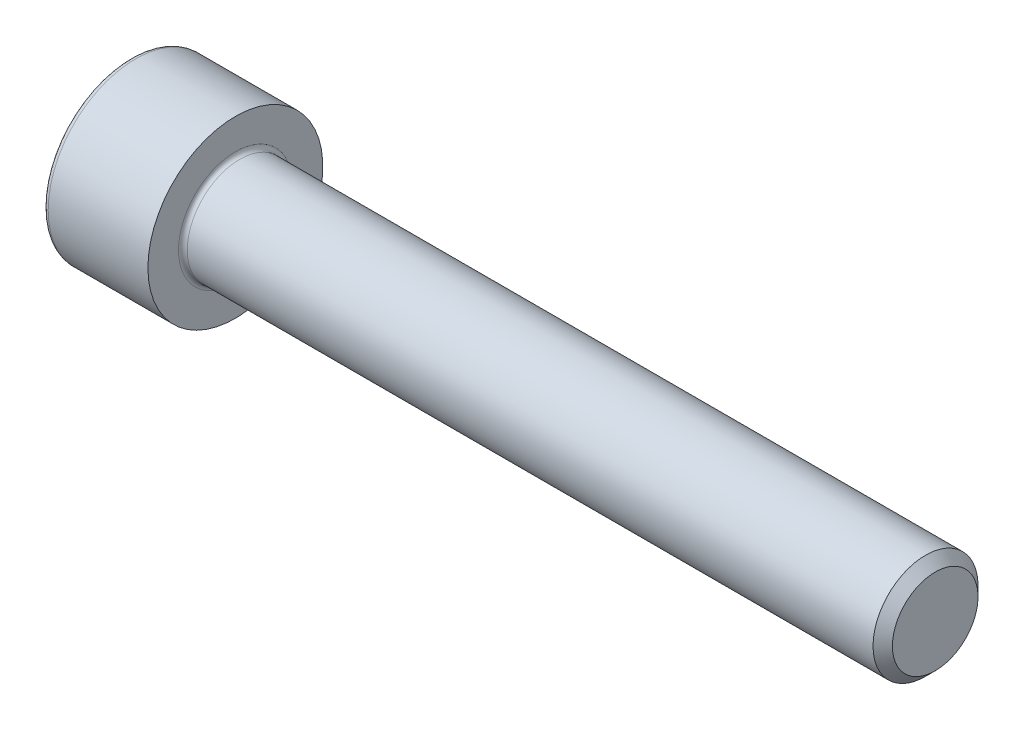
ISO-10303-21;
HEADER;
FILE_DESCRIPTION(('STEP AP214'),'2;1');
FILE_NAME('part.step','',(''),(''),'','','');
FILE_SCHEMA(('AUTOMOTIVE_DESIGN { 1 0 10303 214 1 1 1 1 }'));
ENDSEC;
DATA;
#1=APPLICATION_CONTEXT('core data for automotive mechanical design processes');
#2=APPLICATION_PROTOCOL_DEFINITION('international standard','automotive_design',2000,#1);
#3=PRODUCT_CONTEXT('',#1,'mechanical');
#4=PRODUCT('Part','Part','',(#3));
#5=PRODUCT_RELATED_PRODUCT_CATEGORY('part','',(#4));
#6=PRODUCT_DEFINITION_FORMATION('','',#4);
#7=PRODUCT_DEFINITION_CONTEXT('part definition',#1,'design');
#8=PRODUCT_DEFINITION('design','',#6,#7);
#9=PRODUCT_DEFINITION_SHAPE('','',#8);
#10=(LENGTH_UNIT() NAMED_UNIT(*) SI_UNIT(.MILLI.,.METRE.));
#11=(NAMED_UNIT(*) PLANE_ANGLE_UNIT() SI_UNIT($,.RADIAN.));
#12=(NAMED_UNIT(*) SI_UNIT($,.STERADIAN.) SOLID_ANGLE_UNIT());
#13=UNCERTAINTY_MEASURE_WITH_UNIT(LENGTH_MEASURE(1.E-05),#10,'distance_accuracy_value','');
#14=(GEOMETRIC_REPRESENTATION_CONTEXT(3) GLOBAL_UNCERTAINTY_ASSIGNED_CONTEXT((#13)) GLOBAL_UNIT_ASSIGNED_CONTEXT((#10,
#11,#12)) REPRESENTATION_CONTEXT('',''));
#15=CARTESIAN_POINT('',(0.,0.,0.));
#16=DIRECTION('',(0.,0.,1.));
#17=DIRECTION('',(1.,0.,0.));
#18=AXIS2_PLACEMENT_3D('',#15,#16,#17);
#19=CARTESIAN_POINT('',(0.,0.,0.));
#20=DIRECTION('',(-1.,0.,0.));
#21=DIRECTION('',(0.,0.,1.));
#22=AXIS2_PLACEMENT_3D('',#19,#20,#21);
#23=PLANE('',#22);
#24=DIRECTION('',(0.,-0.499999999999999,0.866025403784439));
#25=VECTOR('',#24,1.);
#26=CARTESIAN_POINT('',(0.,2.93524876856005,0.));
#27=LINE('',#26,#25);
#28=CARTESIAN_POINT('',(0.,2.93524876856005,0.));
#29=VERTEX_POINT('',#28);
#30=CARTESIAN_POINT('',(0.,1.46762438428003,2.542));
#31=VERTEX_POINT('',#30);
#32=EDGE_CURVE('E264',#29,#31,#27,.T.);
#33=ORIENTED_EDGE('',*,*,#32,.T.);
#34=DIRECTION('',(0.,1.,0.));
#35=VECTOR('',#34,1.);
#36=CARTESIAN_POINT('',(0.,-1.46762438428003,2.542));
#37=LINE('',#36,#35);
#38=CARTESIAN_POINT('',(0.,-1.46762438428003,2.542));
#39=VERTEX_POINT('',#38);
#40=EDGE_CURVE('E136',#39,#31,#37,.T.);
#41=ORIENTED_EDGE('',*,*,#40,.F.);
#42=DIRECTION('',(0.,-0.500000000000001,-0.866025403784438));
#43=VECTOR('',#42,1.);
#44=CARTESIAN_POINT('',(0.,-1.46762438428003,2.542));
#45=LINE('',#44,#43);
#46=CARTESIAN_POINT('',(0.,-2.93524876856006,0.));
#47=VERTEX_POINT('',#46);
#48=EDGE_CURVE('E267',#39,#47,#45,.T.);
#49=ORIENTED_EDGE('',*,*,#48,.T.);
#50=DIRECTION('',(0.,0.499999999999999,-0.866025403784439));
#51=VECTOR('',#50,1.);
#52=CARTESIAN_POINT('',(0.,-2.93524876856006,0.));
#53=LINE('',#52,#51);
#54=CARTESIAN_POINT('',(0.,-1.46762438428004,-2.542));
#55=VERTEX_POINT('',#54);
#56=EDGE_CURVE('E270',#47,#55,#53,.T.);
#57=ORIENTED_EDGE('',*,*,#56,.T.);
#58=DIRECTION('',(0.,-1.,0.));
#59=VECTOR('',#58,1.);
#60=CARTESIAN_POINT('',(0.,1.46762438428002,-2.542));
#61=LINE('',#60,#59);
#62=CARTESIAN_POINT('',(0.,1.46762438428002,-2.542));
#63=VERTEX_POINT('',#62);
#64=EDGE_CURVE('E273',#63,#55,#61,.T.);
#65=ORIENTED_EDGE('',*,*,#64,.F.);
#66=DIRECTION('',(0.,-0.500000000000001,-0.866025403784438));
#67=VECTOR('',#66,1.);
#68=CARTESIAN_POINT('',(0.,2.93524876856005,0.));
#69=LINE('',#68,#67);
#70=EDGE_CURVE('E131',#29,#63,#69,.T.);
#71=ORIENTED_EDGE('',*,*,#70,.F.);
#72=EDGE_LOOP('',(#33,#41,#49,#57,#65,#71));
#73=FACE_BOUND('',#72,.T.);
#74=CARTESIAN_POINT('',(0.,0.,0.));
#75=DIRECTION('',(-1.,0.,0.));
#76=DIRECTION('',(0.,0.,1.));
#77=AXIS2_PLACEMENT_3D('',#74,#75,#76);
#78=CIRCLE('',#77,4.7);
#79=CARTESIAN_POINT('',(0.,0.,4.7));
#80=VERTEX_POINT('',#79);
#81=EDGE_CURVE('E48',#80,#80,#78,.T.);
#82=ORIENTED_EDGE('',*,*,#81,.T.);
#83=EDGE_LOOP('',(#82));
#84=FACE_BOUND('',#83,.T.);
#85=ADVANCED_FACE('F40',(#73,#84),#23,.T.);
#86=CARTESIAN_POINT('',(-31.75,0.,0.));
#87=DIRECTION('',(-1.,0.,0.));
#88=DIRECTION('',(0.,0.,1.));
#89=AXIS2_PLACEMENT_3D('',#86,#87,#88);
#90=CYLINDRICAL_SURFACE('',#89,5.);
#91=CARTESIAN_POINT('',(0.300000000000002,0.,0.));
#92=DIRECTION('',(-1.,0.,0.));
#93=DIRECTION('',(0.,0.,1.));
#94=AXIS2_PLACEMENT_3D('',#91,#92,#93);
#95=CIRCLE('',#94,5.);
#96=CARTESIAN_POINT('',(0.300000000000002,0.,5.));
#97=VERTEX_POINT('',#96);
#98=EDGE_CURVE('E11',#97,#97,#95,.F.);
#99=ORIENTED_EDGE('',*,*,#98,.T.);
#100=EDGE_LOOP('',(#99));
#101=FACE_BOUND('',#100,.T.);
#102=CARTESIAN_POINT('',(6.,0.,0.));
#103=DIRECTION('',(-1.,0.,0.));
#104=DIRECTION('',(0.,0.,1.));
#105=AXIS2_PLACEMENT_3D('',#102,#103,#104);
#106=CIRCLE('',#105,5.);
#107=CARTESIAN_POINT('',(6.,0.,5.));
#108=VERTEX_POINT('',#107);
#109=EDGE_CURVE('E154',#108,#108,#106,.T.);
#110=ORIENTED_EDGE('',*,*,#109,.T.);
#111=EDGE_LOOP('',(#110));
#112=FACE_BOUND('',#111,.T.);
#113=ADVANCED_FACE('F178',(#101,#112),#90,.T.);
#114=CARTESIAN_POINT('',(6.,5.,0.));
#115=DIRECTION('',(1.,0.,0.));
#116=DIRECTION('',(0.,0.,-1.));
#117=AXIS2_PLACEMENT_3D('',#114,#115,#116);
#118=PLANE('',#117);
#119=CARTESIAN_POINT('',(6.,0.,0.));
#120=DIRECTION('',(1.,0.,0.));
#121=DIRECTION('',(0.,0.,-1.));
#122=AXIS2_PLACEMENT_3D('',#119,#120,#121);
#123=CIRCLE('',#122,3.25);
#124=CARTESIAN_POINT('',(6.,0.,-3.25));
#125=VERTEX_POINT('',#124);
#126=EDGE_CURVE('E157',#125,#125,#123,.F.);
#127=ORIENTED_EDGE('',*,*,#126,.T.);
#128=EDGE_LOOP('',(#127));
#129=FACE_BOUND('',#128,.T.);
#130=ORIENTED_EDGE('',*,*,#109,.F.);
#131=EDGE_LOOP('',(#130));
#132=FACE_BOUND('',#131,.T.);
#133=ADVANCED_FACE('F184',(#129,#132),#118,.T.);
#134=CARTESIAN_POINT('',(-31.75,0.,0.));
#135=DIRECTION('',(-1.,0.,0.));
#136=DIRECTION('',(0.,0.,1.));
#137=AXIS2_PLACEMENT_3D('',#134,#135,#136);
#138=CYLINDRICAL_SURFACE('',#137,3.);
#139=CARTESIAN_POINT('',(6.25,0.,0.));
#140=DIRECTION('',(1.,0.,0.));
#141=DIRECTION('',(0.,0.,-1.));
#142=AXIS2_PLACEMENT_3D('',#139,#140,#141);
#143=CIRCLE('',#142,3.);
#144=CARTESIAN_POINT('',(6.25,0.,-3.));
#145=VERTEX_POINT('',#144);
#146=EDGE_CURVE('E160',#145,#145,#143,.T.);
#147=ORIENTED_EDGE('',*,*,#146,.T.);
#148=EDGE_LOOP('',(#147));
#149=FACE_BOUND('',#148,.T.);
#150=CARTESIAN_POINT('',(45.4455,0.,0.));
#151=DIRECTION('',(-1.,0.,0.));
#152=DIRECTION('',(0.,0.,1.));
#153=AXIS2_PLACEMENT_3D('',#150,#151,#152);
#154=CIRCLE('',#153,3.);
#155=CARTESIAN_POINT('',(45.4455,0.,3.));
#156=VERTEX_POINT('',#155);
#157=EDGE_CURVE('E151',#156,#156,#154,.T.);
#158=ORIENTED_EDGE('',*,*,#157,.T.);
#159=EDGE_LOOP('',(#158));
#160=FACE_BOUND('',#159,.T.);
#161=ADVANCED_FACE('F190',(#149,#160),#138,.T.);
#162=CARTESIAN_POINT('',(46.,0.,0.));
#163=DIRECTION('',(-1.,0.,0.));
#164=DIRECTION('',(0.,0.,1.));
#165=AXIS2_PLACEMENT_3D('',#162,#163,#164);
#166=CONICAL_SURFACE('',#165,2.4455,0.785398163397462);
#167=ORIENTED_EDGE('',*,*,#157,.F.);
#168=EDGE_LOOP('',(#167));
#169=FACE_BOUND('',#168,.T.);
#170=CARTESIAN_POINT('',(46.,0.,0.));
#171=DIRECTION('',(-1.,0.,0.));
#172=DIRECTION('',(0.,0.,1.));
#173=AXIS2_PLACEMENT_3D('',#170,#171,#172);
#174=CIRCLE('',#173,2.4455);
#175=CARTESIAN_POINT('',(46.,0.,2.4455));
#176=VERTEX_POINT('',#175);
#177=EDGE_CURVE('E147',#176,#176,#174,.T.);
#178=ORIENTED_EDGE('',*,*,#177,.T.);
#179=EDGE_LOOP('',(#178));
#180=FACE_BOUND('',#179,.T.);
#181=ADVANCED_FACE('F194',(#169,#180),#166,.T.);
#182=CARTESIAN_POINT('',(46.,2.4455,0.));
#183=DIRECTION('',(1.,0.,0.));
#184=DIRECTION('',(0.,0.,-1.));
#185=AXIS2_PLACEMENT_3D('',#182,#183,#184);
#186=PLANE('',#185);
#187=ORIENTED_EDGE('',*,*,#177,.F.);
#188=EDGE_LOOP('',(#187));
#189=FACE_BOUND('',#188,.T.);
#190=ADVANCED_FACE('F174',(#189),#186,.T.);
#191=CARTESIAN_POINT('',(6.25,0.,0.));
#192=DIRECTION('',(1.,0.,0.));
#193=DIRECTION('',(0.,0.,-1.));
#194=AXIS2_PLACEMENT_3D('',#191,#192,#193);
#195=TOROIDAL_SURFACE('',#194,3.25,0.25);
#196=ORIENTED_EDGE('',*,*,#146,.F.);
#197=EDGE_LOOP('',(#196));
#198=FACE_BOUND('',#197,.T.);
#199=ORIENTED_EDGE('',*,*,#126,.F.);
#200=EDGE_LOOP('',(#199));
#201=FACE_BOUND('',#200,.T.);
#202=ADVANCED_FACE('F167',(#198,#201),#195,.F.);
#203=CARTESIAN_POINT('',(0.300000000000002,0.,0.));
#204=DIRECTION('',(-1.,0.,0.));
#205=DIRECTION('',(0.,0.,1.));
#206=AXIS2_PLACEMENT_3D('',#203,#204,#205);
#207=TOROIDAL_SURFACE('',#206,4.7,0.3);
#208=ORIENTED_EDGE('',*,*,#98,.F.);
#209=EDGE_LOOP('',(#208));
#210=FACE_BOUND('',#209,.T.);
#211=ORIENTED_EDGE('',*,*,#81,.F.);
#212=EDGE_LOOP('',(#211));
#213=FACE_BOUND('',#212,.T.);
#214=ADVANCED_FACE('F42',(#210,#213),#207,.T.);
#215=CARTESIAN_POINT('',(3.,2.93524876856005,0.));
#216=DIRECTION('',(0.,-0.866025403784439,-0.499999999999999));
#217=DIRECTION('',(0.,0.499999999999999,-0.866025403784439));
#218=AXIS2_PLACEMENT_3D('',#215,#216,#217);
#219=PLANE('',#218);
#220=ORIENTED_EDGE('',*,*,#32,.F.);
#221=DIRECTION('',(-1.,0.,0.));
#222=VECTOR('',#221,1.);
#223=CARTESIAN_POINT('',(3.,2.93524876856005,0.));
#224=LINE('',#223,#222);
#225=CARTESIAN_POINT('',(3.,2.93524876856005,0.));
#226=VERTEX_POINT('',#225);
#227=EDGE_CURVE('E254',#226,#29,#224,.T.);
#228=ORIENTED_EDGE('',*,*,#227,.F.);
#229=DIRECTION('',(0.,-0.499999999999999,0.866025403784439));
#230=VECTOR('',#229,1.);
#231=CARTESIAN_POINT('',(3.,2.93524876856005,0.));
#232=LINE('',#231,#230);
#233=CARTESIAN_POINT('',(3.,2.20143657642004,1.271));
#234=VERTEX_POINT('',#233);
#235=EDGE_CURVE('E123',#226,#234,#232,.T.);
#236=ORIENTED_EDGE('',*,*,#235,.T.);
#237=CARTESIAN_POINT('',(3.,1.46762438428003,2.542));
#238=VERTEX_POINT('',#237);
#239=EDGE_CURVE('E114',#234,#238,#232,.T.);
#240=ORIENTED_EDGE('',*,*,#239,.T.);
#241=DIRECTION('',(-1.,0.,0.));
#242=VECTOR('',#241,1.);
#243=CARTESIAN_POINT('',(3.,1.46762438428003,2.542));
#244=LINE('',#243,#242);
#245=EDGE_CURVE('E128',#238,#31,#244,.T.);
#246=ORIENTED_EDGE('',*,*,#245,.T.);
#247=EDGE_LOOP('',(#220,#228,#236,#240,#246));
#248=FACE_BOUND('',#247,.T.);
#249=ADVANCED_FACE('F127',(#248),#219,.T.);
#250=CARTESIAN_POINT('',(3.,-1.46762438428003,2.542));
#251=DIRECTION('',(0.,0.,1.));
#252=DIRECTION('',(0.,-1.,0.));
#253=AXIS2_PLACEMENT_3D('',#250,#251,#252);
#254=PLANE('',#253);
#255=ORIENTED_EDGE('',*,*,#40,.T.);
#256=ORIENTED_EDGE('',*,*,#245,.F.);
#257=DIRECTION('',(0.,1.,0.));
#258=VECTOR('',#257,1.);
#259=CARTESIAN_POINT('',(3.,-1.46762438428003,2.542));
#260=LINE('',#259,#258);
#261=CARTESIAN_POINT('',(3.,0.,2.542));
#262=VERTEX_POINT('',#261);
#263=EDGE_CURVE('E111',#262,#238,#260,.T.);
#264=ORIENTED_EDGE('',*,*,#263,.F.);
#265=CARTESIAN_POINT('',(3.,-1.46762438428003,2.542));
#266=VERTEX_POINT('',#265);
#267=EDGE_CURVE('E122',#266,#262,#260,.T.);
#268=ORIENTED_EDGE('',*,*,#267,.F.);
#269=DIRECTION('',(-1.,0.,0.));
#270=VECTOR('',#269,1.);
#271=CARTESIAN_POINT('',(3.,-1.46762438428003,2.542));
#272=LINE('',#271,#270);
#273=EDGE_CURVE('E138',#266,#39,#272,.T.);
#274=ORIENTED_EDGE('',*,*,#273,.T.);
#275=EDGE_LOOP('',(#255,#256,#264,#268,#274));
#276=FACE_BOUND('',#275,.T.);
#277=ADVANCED_FACE('F133',(#276),#254,.F.);
#278=CARTESIAN_POINT('',(3.,-1.46762438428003,2.542));
#279=DIRECTION('',(0.,0.866025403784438,-0.500000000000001));
#280=DIRECTION('',(0.,0.500000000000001,0.866025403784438));
#281=AXIS2_PLACEMENT_3D('',#278,#279,#280);
#282=PLANE('',#281);
#283=ORIENTED_EDGE('',*,*,#48,.F.);
#284=ORIENTED_EDGE('',*,*,#273,.F.);
#285=DIRECTION('',(0.,-0.500000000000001,-0.866025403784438));
#286=VECTOR('',#285,1.);
#287=CARTESIAN_POINT('',(3.,-1.46762438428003,2.542));
#288=LINE('',#287,#286);
#289=CARTESIAN_POINT('',(3.,-2.20143657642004,1.271));
#290=VERTEX_POINT('',#289);
#291=EDGE_CURVE('E293',#266,#290,#288,.T.);
#292=ORIENTED_EDGE('',*,*,#291,.T.);
#293=CARTESIAN_POINT('',(3.,-2.93524876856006,0.));
#294=VERTEX_POINT('',#293);
#295=EDGE_CURVE('E282',#290,#294,#288,.T.);
#296=ORIENTED_EDGE('',*,*,#295,.T.);
#297=DIRECTION('',(-1.,0.,0.));
#298=VECTOR('',#297,1.);
#299=CARTESIAN_POINT('',(3.,-2.93524876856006,0.));
#300=LINE('',#299,#298);
#301=EDGE_CURVE('E143',#294,#47,#300,.T.);
#302=ORIENTED_EDGE('',*,*,#301,.T.);
#303=EDGE_LOOP('',(#283,#284,#292,#296,#302));
#304=FACE_BOUND('',#303,.T.);
#305=ADVANCED_FACE('F208',(#304),#282,.T.);
#306=CARTESIAN_POINT('',(3.,-2.93524876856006,0.));
#307=DIRECTION('',(0.,0.866025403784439,0.499999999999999));
#308=DIRECTION('',(0.,-0.499999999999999,0.866025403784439));
#309=AXIS2_PLACEMENT_3D('',#306,#307,#308);
#310=PLANE('',#309);
#311=ORIENTED_EDGE('',*,*,#56,.F.);
#312=ORIENTED_EDGE('',*,*,#301,.F.);
#313=DIRECTION('',(0.,0.499999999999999,-0.866025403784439));
#314=VECTOR('',#313,1.);
#315=CARTESIAN_POINT('',(3.,-2.93524876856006,0.));
#316=LINE('',#315,#314);
#317=CARTESIAN_POINT('',(3.,-2.20143657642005,-1.271));
#318=VERTEX_POINT('',#317);
#319=EDGE_CURVE('E260',#294,#318,#316,.T.);
#320=ORIENTED_EDGE('',*,*,#319,.T.);
#321=CARTESIAN_POINT('',(3.,-1.46762438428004,-2.542));
#322=VERTEX_POINT('',#321);
#323=EDGE_CURVE('E292',#318,#322,#316,.T.);
#324=ORIENTED_EDGE('',*,*,#323,.T.);
#325=DIRECTION('',(-1.,0.,0.));
#326=VECTOR('',#325,1.);
#327=CARTESIAN_POINT('',(3.,-1.46762438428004,-2.542));
#328=LINE('',#327,#326);
#329=EDGE_CURVE('E253',#322,#55,#328,.T.);
#330=ORIENTED_EDGE('',*,*,#329,.T.);
#331=EDGE_LOOP('',(#311,#312,#320,#324,#330));
#332=FACE_BOUND('',#331,.T.);
#333=ADVANCED_FACE('F211',(#332),#310,.T.);
#334=CARTESIAN_POINT('',(3.,1.46762438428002,-2.542));
#335=DIRECTION('',(0.,0.,-1.));
#336=DIRECTION('',(0.,1.,0.));
#337=AXIS2_PLACEMENT_3D('',#334,#335,#336);
#338=PLANE('',#337);
#339=ORIENTED_EDGE('',*,*,#64,.T.);
#340=ORIENTED_EDGE('',*,*,#329,.F.);
#341=DIRECTION('',(0.,-1.,0.));
#342=VECTOR('',#341,1.);
#343=CARTESIAN_POINT('',(3.,1.46762438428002,-2.542));
#344=LINE('',#343,#342);
#345=CARTESIAN_POINT('',(3.,0.,-2.542));
#346=VERTEX_POINT('',#345);
#347=EDGE_CURVE('E257',#346,#322,#344,.T.);
#348=ORIENTED_EDGE('',*,*,#347,.F.);
#349=CARTESIAN_POINT('',(3.,1.46762438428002,-2.542));
#350=VERTEX_POINT('',#349);
#351=EDGE_CURVE('E55',#350,#346,#344,.T.);
#352=ORIENTED_EDGE('',*,*,#351,.F.);
#353=DIRECTION('',(-1.,0.,0.));
#354=VECTOR('',#353,1.);
#355=CARTESIAN_POINT('',(3.,1.46762438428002,-2.542));
#356=LINE('',#355,#354);
#357=EDGE_CURVE('E250',#350,#63,#356,.T.);
#358=ORIENTED_EDGE('',*,*,#357,.T.);
#359=EDGE_LOOP('',(#339,#340,#348,#352,#358));
#360=FACE_BOUND('',#359,.T.);
#361=ADVANCED_FACE('F215',(#360),#338,.F.);
#362=CARTESIAN_POINT('',(3.,2.93524876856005,0.));
#363=DIRECTION('',(0.,0.866025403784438,-0.500000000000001));
#364=DIRECTION('',(0.,0.500000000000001,0.866025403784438));
#365=AXIS2_PLACEMENT_3D('',#362,#363,#364);
#366=PLANE('',#365);
#367=ORIENTED_EDGE('',*,*,#70,.T.);
#368=ORIENTED_EDGE('',*,*,#357,.F.);
#369=DIRECTION('',(0.,-0.500000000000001,-0.866025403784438));
#370=VECTOR('',#369,1.);
#371=CARTESIAN_POINT('',(3.,2.93524876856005,0.));
#372=LINE('',#371,#370);
#373=CARTESIAN_POINT('',(3.,2.20143657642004,-1.271));
#374=VERTEX_POINT('',#373);
#375=EDGE_CURVE('E240',#374,#350,#372,.T.);
#376=ORIENTED_EDGE('',*,*,#375,.F.);
#377=EDGE_CURVE('E246',#226,#374,#372,.T.);
#378=ORIENTED_EDGE('',*,*,#377,.F.);
#379=ORIENTED_EDGE('',*,*,#227,.T.);
#380=EDGE_LOOP('',(#367,#368,#376,#378,#379));
#381=FACE_BOUND('',#380,.T.);
#382=ADVANCED_FACE('F219',(#381),#366,.F.);
#383=CARTESIAN_POINT('',(3.,4.40287315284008,-2.54200000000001));
#384=DIRECTION('',(1.,0.,0.));
#385=DIRECTION('',(0.,0.,-1.));
#386=AXIS2_PLACEMENT_3D('',#383,#384,#385);
#387=PLANE('',#386);
#388=ORIENTED_EDGE('',*,*,#347,.T.);
#389=ORIENTED_EDGE('',*,*,#323,.F.);
#390=CARTESIAN_POINT('',(3.,0.,0.));
#391=DIRECTION('',(-1.,0.,0.));
#392=DIRECTION('',(0.,0.,1.));
#393=AXIS2_PLACEMENT_3D('',#390,#391,#392);
#394=CIRCLE('',#393,2.542);
#395=EDGE_CURVE('E288',#346,#318,#394,.T.);
#396=ORIENTED_EDGE('',*,*,#395,.F.);
#397=EDGE_LOOP('',(#388,#389,#396));
#398=FACE_BOUND('',#397,.T.);
#399=ADVANCED_FACE('F223',(#398),#387,.F.);
#400=ORIENTED_EDGE('',*,*,#319,.F.);
#401=ORIENTED_EDGE('',*,*,#295,.F.);
#402=EDGE_CURVE('E141',#318,#290,#394,.T.);
#403=ORIENTED_EDGE('',*,*,#402,.F.);
#404=EDGE_LOOP('',(#400,#401,#403));
#405=FACE_BOUND('',#404,.T.);
#406=ADVANCED_FACE('F226',(#405),#387,.F.);
#407=ORIENTED_EDGE('',*,*,#291,.F.);
#408=ORIENTED_EDGE('',*,*,#267,.T.);
#409=EDGE_CURVE('E137',#290,#262,#394,.T.);
#410=ORIENTED_EDGE('',*,*,#409,.F.);
#411=EDGE_LOOP('',(#407,#408,#410));
#412=FACE_BOUND('',#411,.T.);
#413=ADVANCED_FACE('F231',(#412),#387,.F.);
#414=ORIENTED_EDGE('',*,*,#263,.T.);
#415=ORIENTED_EDGE('',*,*,#239,.F.);
#416=EDGE_CURVE('E117',#262,#234,#394,.T.);
#417=ORIENTED_EDGE('',*,*,#416,.F.);
#418=EDGE_LOOP('',(#414,#415,#417));
#419=FACE_BOUND('',#418,.T.);
#420=ADVANCED_FACE('F113',(#419),#387,.F.);
#421=ORIENTED_EDGE('',*,*,#235,.F.);
#422=ORIENTED_EDGE('',*,*,#377,.T.);
#423=EDGE_CURVE('E148',#234,#374,#394,.T.);
#424=ORIENTED_EDGE('',*,*,#423,.F.);
#425=EDGE_LOOP('',(#421,#422,#424));
#426=FACE_BOUND('',#425,.T.);
#427=ADVANCED_FACE('F234',(#426),#387,.F.);
#428=ORIENTED_EDGE('',*,*,#375,.T.);
#429=ORIENTED_EDGE('',*,*,#351,.T.);
#430=EDGE_CURVE('E243',#374,#346,#394,.T.);
#431=ORIENTED_EDGE('',*,*,#430,.F.);
#432=EDGE_LOOP('',(#428,#429,#431));
#433=FACE_BOUND('',#432,.T.);
#434=ADVANCED_FACE('F204',(#433),#387,.F.);
#435=CARTESIAN_POINT('',(3.,0.,0.));
#436=DIRECTION('',(-1.,0.,0.));
#437=DIRECTION('',(0.,0.,1.));
#438=AXIS2_PLACEMENT_3D('',#435,#436,#437);
#439=CONICAL_SURFACE('',#438,2.542,1.04719755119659);
#440=CARTESIAN_POINT('',(4.46762438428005,0.,0.));
#441=VERTEX_POINT('',#440);
#442=VERTEX_LOOP('',#441);
#443=FACE_BOUND('',#442,.T.);
#444=ORIENTED_EDGE('',*,*,#416,.T.);
#445=ORIENTED_EDGE('',*,*,#423,.T.);
#446=ORIENTED_EDGE('',*,*,#430,.T.);
#447=ORIENTED_EDGE('',*,*,#395,.T.);
#448=ORIENTED_EDGE('',*,*,#402,.T.);
#449=ORIENTED_EDGE('',*,*,#409,.T.);
#450=EDGE_LOOP('',(#444,#445,#446,#447,#448,#449));
#451=FACE_BOUND('',#450,.T.);
#452=ADVANCED_FACE('F202',(#443,#451),#439,.F.);
#453=CLOSED_SHELL('',(#85,#113,#133,#161,#181,#190,#202,#214,#249,#277,#305,#333,#361,#382,#399,
#406,#413,#420,#427,#434,#452));
#454=MANIFOLD_SOLID_BREP('B2',#453);
#455=ADVANCED_BREP_SHAPE_REPRESENTATION('',(#18,#454),#14);
#456=SHAPE_DEFINITION_REPRESENTATION(#9,#455);
ENDSEC;
END-ISO-10303-21;
